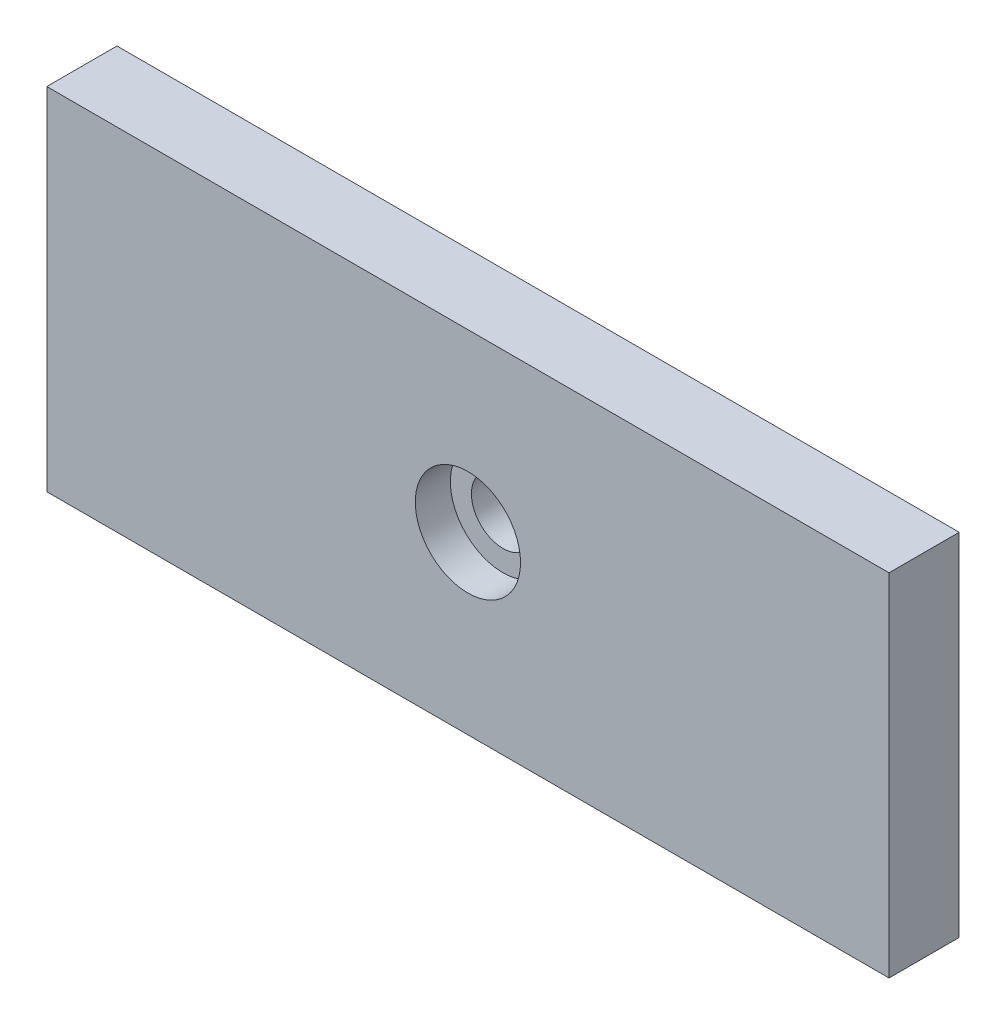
from build123d import *

# Parameters (mm, degrees)
ESQUISSE1_W                                        = 120
ESQUISSE1_H                                        = 50
BASE_EXTRUSION_DEPTH                               = 10
CHAMBRAGE_POUR_VIS_T_TE_CYLINDRIQUE_FE_D           = 9
CHAMBRAGE_POUR_VIS_T_TE_CYLINDRIQUE_FE_CBORE_D     = 15
CHAMBRAGE_POUR_VIS_T_TE_CYLINDRIQUE_FE_CBORE_DEPTH = 5


with BuildPart() as part:
    # Esquisse1 → Base-Extrusion (new body)
    with BuildSketch(Plane.XY):
        with Locations((-1556.555845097, -1000)):
            Rectangle(ESQUISSE1_W, ESQUISSE1_H)
    extrude(amount=BASE_EXTRUSION_DEPTH)

    # Chambrage pour vis _ t_te cylindrique fe (through all)
    with Locations(Plane(origin=(-2267.277365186, -2626.599138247, 10), x_dir=(0, 1, 0), z_dir=(0, 0, 1))):
        with Locations((1626.599138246, -710.721517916)):
            CounterBoreHole(CHAMBRAGE_POUR_VIS_T_TE_CYLINDRIQUE_FE_D / 2, CHAMBRAGE_POUR_VIS_T_TE_CYLINDRIQUE_FE_CBORE_D / 2, CHAMBRAGE_POUR_VIS_T_TE_CYLINDRIQUE_FE_CBORE_DEPTH)


solid = part.part
